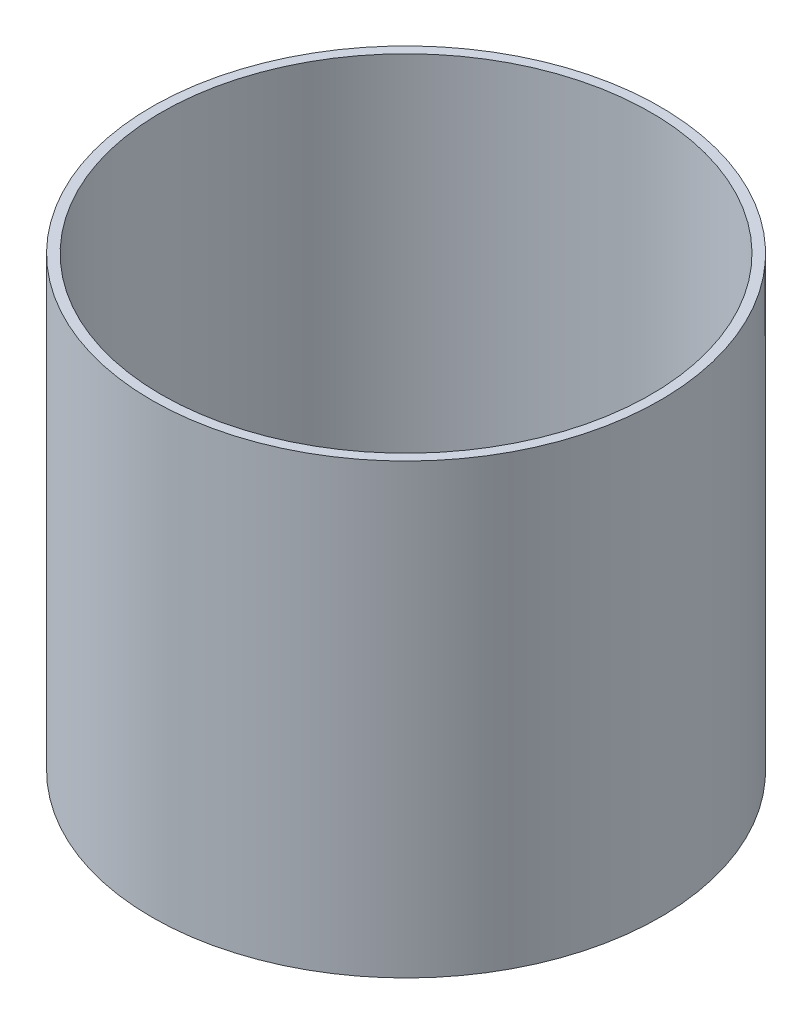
ISO-10303-21;
HEADER;
FILE_DESCRIPTION(('STEP AP214'),'2;1');
FILE_NAME('part.step','',(''),(''),'','','');
FILE_SCHEMA(('AUTOMOTIVE_DESIGN { 1 0 10303 214 1 1 1 1 }'));
ENDSEC;
DATA;
#1=APPLICATION_CONTEXT('core data for automotive mechanical design processes');
#2=APPLICATION_PROTOCOL_DEFINITION('international standard','automotive_design',2000,#1);
#3=PRODUCT_CONTEXT('',#1,'mechanical');
#4=PRODUCT('Part','Part','',(#3));
#5=PRODUCT_RELATED_PRODUCT_CATEGORY('part','',(#4));
#6=PRODUCT_DEFINITION_FORMATION('','',#4);
#7=PRODUCT_DEFINITION_CONTEXT('part definition',#1,'design');
#8=PRODUCT_DEFINITION('design','',#6,#7);
#9=PRODUCT_DEFINITION_SHAPE('','',#8);
#10=(LENGTH_UNIT() NAMED_UNIT(*) SI_UNIT(.MILLI.,.METRE.));
#11=(NAMED_UNIT(*) PLANE_ANGLE_UNIT() SI_UNIT($,.RADIAN.));
#12=(NAMED_UNIT(*) SI_UNIT($,.STERADIAN.) SOLID_ANGLE_UNIT());
#13=UNCERTAINTY_MEASURE_WITH_UNIT(LENGTH_MEASURE(1.E-05),#10,'distance_accuracy_value','');
#14=(GEOMETRIC_REPRESENTATION_CONTEXT(3) GLOBAL_UNCERTAINTY_ASSIGNED_CONTEXT((#13)) GLOBAL_UNIT_ASSIGNED_CONTEXT((#10,
#11,#12)) REPRESENTATION_CONTEXT('',''));
#15=CARTESIAN_POINT('',(0.,0.,0.));
#16=DIRECTION('',(0.,0.,1.));
#17=DIRECTION('',(1.,0.,0.));
#18=AXIS2_PLACEMENT_3D('',#15,#16,#17);
#19=CARTESIAN_POINT('',(0.,70.,0.));
#20=DIRECTION('',(0.,-1.,0.));
#21=DIRECTION('',(0.,0.,-1.));
#22=AXIS2_PLACEMENT_3D('',#19,#20,#21);
#23=CYLINDRICAL_SURFACE('',#22,39.75);
#24=CARTESIAN_POINT('',(0.,70.,0.));
#25=DIRECTION('',(0.,1.,0.));
#26=DIRECTION('',(0.,0.,1.));
#27=AXIS2_PLACEMENT_3D('',#24,#25,#26);
#28=CIRCLE('',#27,39.75);
#29=CARTESIAN_POINT('',(0.,70.,39.75));
#30=VERTEX_POINT('',#29);
#31=EDGE_CURVE('E10',#30,#30,#28,.T.);
#32=ORIENTED_EDGE('',*,*,#31,.F.);
#33=EDGE_LOOP('',(#32));
#34=FACE_BOUND('',#33,.T.);
#35=CARTESIAN_POINT('',(0.,0.,0.));
#36=DIRECTION('',(0.,1.,0.));
#37=DIRECTION('',(0.,0.,1.));
#38=AXIS2_PLACEMENT_3D('',#35,#36,#37);
#39=CIRCLE('',#38,39.75);
#40=CARTESIAN_POINT('',(0.,0.,39.75));
#41=VERTEX_POINT('',#40);
#42=EDGE_CURVE('E42',#41,#41,#39,.T.);
#43=ORIENTED_EDGE('',*,*,#42,.T.);
#44=EDGE_LOOP('',(#43));
#45=FACE_BOUND('',#44,.T.);
#46=ADVANCED_FACE('F39',(#34,#45),#23,.T.);
#47=CARTESIAN_POINT('',(0.,70.,0.));
#48=DIRECTION('',(0.,1.,0.));
#49=DIRECTION('',(0.,0.,1.));
#50=AXIS2_PLACEMENT_3D('',#47,#48,#49);
#51=PLANE('',#50);
#52=CARTESIAN_POINT('',(0.,70.,0.));
#53=DIRECTION('',(0.,1.,0.));
#54=DIRECTION('',(0.,0.,1.));
#55=AXIS2_PLACEMENT_3D('',#52,#53,#54);
#56=CIRCLE('',#55,38.25);
#57=CARTESIAN_POINT('',(0.,70.,38.25));
#58=VERTEX_POINT('',#57);
#59=EDGE_CURVE('E51',#58,#58,#56,.T.);
#60=ORIENTED_EDGE('',*,*,#59,.F.);
#61=EDGE_LOOP('',(#60));
#62=FACE_BOUND('',#61,.T.);
#63=ORIENTED_EDGE('',*,*,#31,.T.);
#64=EDGE_LOOP('',(#63));
#65=FACE_BOUND('',#64,.T.);
#66=ADVANCED_FACE('F64',(#62,#65),#51,.T.);
#67=CARTESIAN_POINT('',(0.,0.,0.));
#68=DIRECTION('',(0.,1.,0.));
#69=DIRECTION('',(0.,0.,1.));
#70=AXIS2_PLACEMENT_3D('',#67,#68,#69);
#71=PLANE('',#70);
#72=CARTESIAN_POINT('',(0.,0.,0.));
#73=DIRECTION('',(0.,1.,0.));
#74=DIRECTION('',(0.,0.,1.));
#75=AXIS2_PLACEMENT_3D('',#72,#73,#74);
#76=CIRCLE('',#75,38.25);
#77=CARTESIAN_POINT('',(0.,0.,38.25));
#78=VERTEX_POINT('',#77);
#79=EDGE_CURVE('E53',#78,#78,#76,.T.);
#80=ORIENTED_EDGE('',*,*,#79,.T.);
#81=EDGE_LOOP('',(#80));
#82=FACE_BOUND('',#81,.T.);
#83=ORIENTED_EDGE('',*,*,#42,.F.);
#84=EDGE_LOOP('',(#83));
#85=FACE_BOUND('',#84,.T.);
#86=ADVANCED_FACE('F66',(#82,#85),#71,.F.);
#87=CARTESIAN_POINT('',(0.,70.,0.));
#88=DIRECTION('',(0.,-1.,0.));
#89=DIRECTION('',(0.,0.,-1.));
#90=AXIS2_PLACEMENT_3D('',#87,#88,#89);
#91=CYLINDRICAL_SURFACE('',#90,38.25);
#92=ORIENTED_EDGE('',*,*,#59,.T.);
#93=EDGE_LOOP('',(#92));
#94=FACE_BOUND('',#93,.T.);
#95=ORIENTED_EDGE('',*,*,#79,.F.);
#96=EDGE_LOOP('',(#95));
#97=FACE_BOUND('',#96,.T.);
#98=ADVANCED_FACE('F61',(#94,#97),#91,.F.);
#99=CLOSED_SHELL('',(#46,#66,#86,#98));
#100=MANIFOLD_SOLID_BREP('B2',#99);
#101=ADVANCED_BREP_SHAPE_REPRESENTATION('',(#18,#100),#14);
#102=SHAPE_DEFINITION_REPRESENTATION(#9,#101);
ENDSEC;
END-ISO-10303-21;
